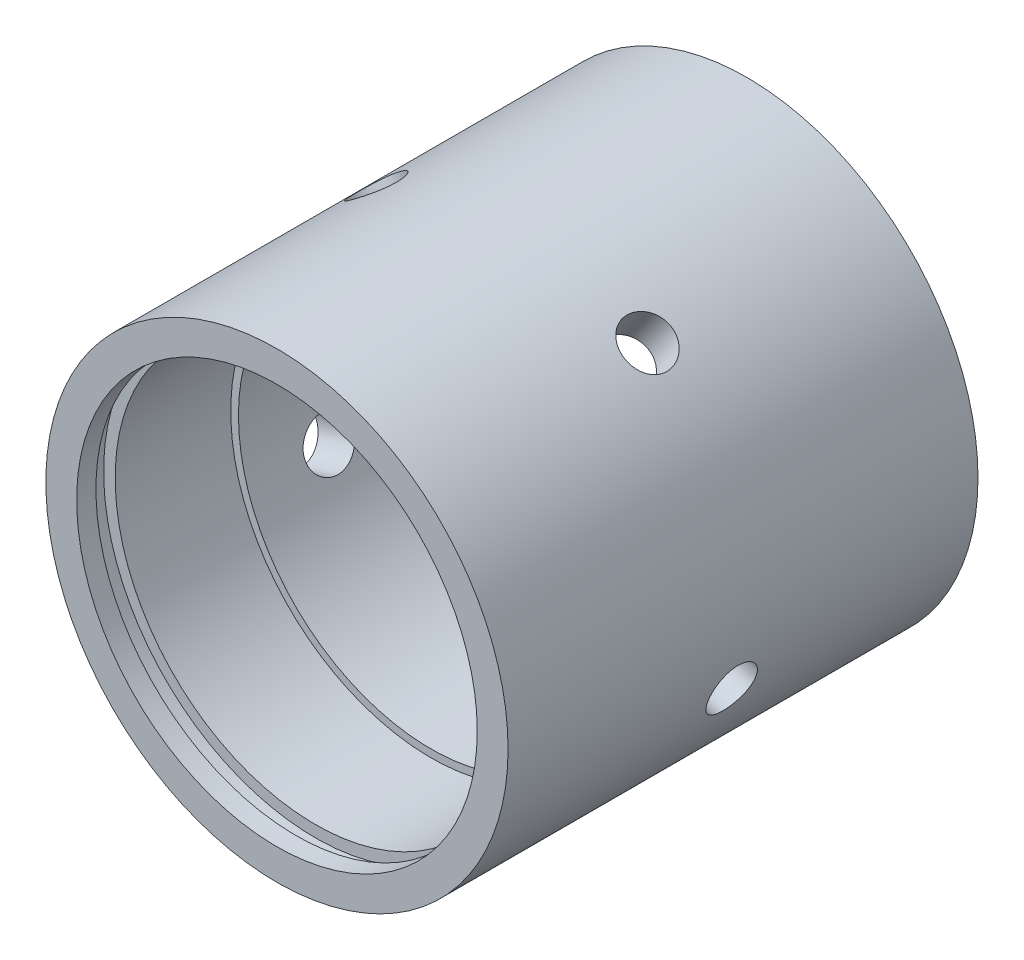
from build123d import *

# Parameters (mm, degrees)
SKETCH1_R                  = 30
SKETCH1_R_2                = 25
EXTRUDE1_DEPTH             = 28.5
SKETCH2_R                  = 26
SKETCH2_R_2                = 12.244784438
CUT_EXTRUDE1_DEPTH         = 18
CROQUIS1_R                 = 27.5
CROQUIS1_R_2               = 12.004739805
CORTAR_EXTRUIR1_DEPTH      = 2.5
EXTRUIR1_START             = 2
CROQUIS2_R                 = 30
CROQUIS2_R_2               = 26
EXTRUIR1_DEPTH             = 2
CORTAR_EXTRUIR2_REACH      = 54.252
CORTAR_EXTRUIR2_END_RADIUS = 30
CROQUIS3_R                 = 3.2
MATRIZC1_COUNT             = 5


with BuildPart() as part:
    # Sketch1 → Extrude1 (new, symmetric)
    with BuildSketch(Plane.XY):
        with Locations(Location((0, 0, 0), (0, 0, 180))):
            Circle(SKETCH1_R)
        with Locations(Location((0, 0, 0), (0, 0, 180))):
            Circle(SKETCH1_R_2, mode=Mode.SUBTRACT)
    extrude(amount=EXTRUDE1_DEPTH, both=True)

    # Sketch2 → Cut-Extrude1 (cut)
    with BuildSketch(Plane.XY.offset(28.5)):
        Circle(SKETCH2_R)
        Circle(SKETCH2_R_2, mode=Mode.SUBTRACT)
    cut_extrude1 = extrude(amount=-CUT_EXTRUDE1_DEPTH, mode=Mode.SUBTRACT)

    # Mirror1: Cut-Extrude1 across plane
    add(cut_extrude1.mirror(Plane.XY), mode=Mode.SUBTRACT)

    # Croquis1 → Cortar-Extruir1 (cut)
    with BuildSketch(Plane.XY.offset(25.5)):
        Circle(CROQUIS1_R)
        Circle(CROQUIS1_R_2, mode=Mode.SUBTRACT)
    cortar_extruir1 = extrude(amount=CORTAR_EXTRUIR1_DEPTH, mode=Mode.SUBTRACT)

    # Croquis2 → Extruir1 (add)
    with BuildSketch(Plane.XY.offset(28.5).offset(EXTRUIR1_START)):
        with Locations(Location((0, 0, 0), (0, 0, 180))):
            Circle(CROQUIS2_R)
        Circle(CROQUIS2_R_2, mode=Mode.SUBTRACT)
    extruir1 = extrude(amount=-EXTRUIR1_DEPTH)

    # Simetr_a1: Cortar-Extruir1, Extruir1 across plane
    add(cortar_extruir1.mirror(Plane.XY), mode=Mode.SUBTRACT)
    add(extruir1.mirror(Plane.XY))

    # Cortar-Extruir2: up to this cylinder (the profile starts inside it)
    cortar_extruir2_end = Plane(origin=(0, 0, 0), z_dir=(0, 0, -1)) * Cylinder(CORTAR_EXTRUIR2_END_RADIUS, 169.504, mode=Mode.PRIVATE)
    # Croquis3 → Cortar-Extruir2 (cut, up to the surface)
    with BuildSketch(Plane(origin=(0, 0, 0), x_dir=(1, 0, 0), z_dir=(0, 1, 0)), mode=Mode.PRIVATE) as cortar_extruir2_sk1:
        with Locations(Location((0, 0, 0), (0, 0, 270))):
            Circle(CROQUIS3_R)
    cortar_extruir2_tool1 = extrude(cortar_extruir2_sk1.sketch, amount=-CORTAR_EXTRUIR2_REACH, mode=Mode.PRIVATE) & cortar_extruir2_end
    cortar_extruir2 = cortar_extruir2_tool1.solids().sort_by_distance((0, 0, 0))[0]
    add(cortar_extruir2, mode=Mode.SUBTRACT)

    # MatrizC1: Cortar-Extruir2 ×5 about axis
    matrizc1_axis = Axis((0, 0, 0), (0, 0, -1))
    for i in range(1, MATRIZC1_COUNT):
        add(cortar_extruir2.rotate(matrizc1_axis, i * 360 / MATRIZC1_COUNT), mode=Mode.SUBTRACT)


solid = part.part
